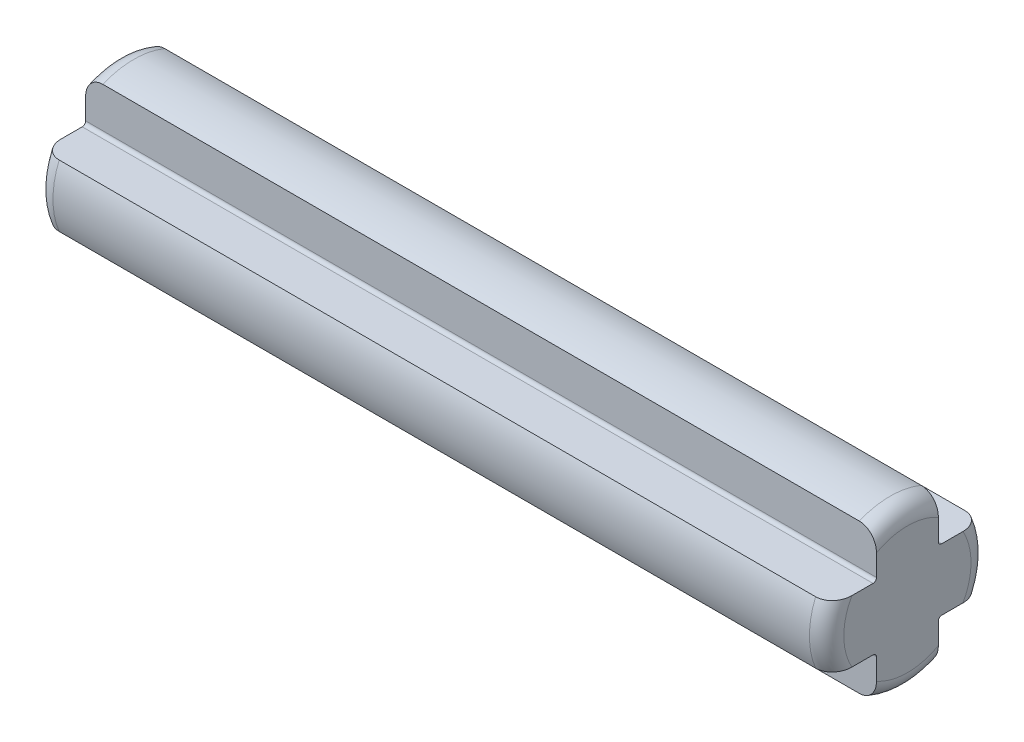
from build123d import *

# Parameters (mm, degrees)
EXTRUIR1_DEPTH = 11.5
REDONDEO1_R    = 0.5


with BuildPart() as part:
    # Croquis1 → Extruir1 (new, symmetric)
    with BuildSketch(Plane(origin=(0, 0, 0), x_dir=(0, 0, -1), z_dir=(1, 0, 0))):
        with BuildLine():
            Line((-0.9, 2.170829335), (-0.9, 1))
            ThreePointArc((-0.9, 1), (-0.929289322, 0.929289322), (-1, 0.9))
            Line((-1, 0.9), (-2.170829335, 0.9))
            ThreePointArc((-2.170829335, 0.9), (-2.35, 0), (-2.170829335, -0.9))
            Line((-2.170829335, -0.9), (-1, -0.9))
            ThreePointArc((-1, -0.9), (-0.929289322, -0.929289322), (-0.9, -1))
            Line((-0.9, -1), (-0.9, -2.170829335))
            ThreePointArc((-0.9, -2.170829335), (0, -2.35), (0.9, -2.170829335))
            Line((0.9, -2.170829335), (0.9, -1))
            ThreePointArc((0.9, -1), (0.929289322, -0.929289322), (1, -0.9))
            Line((1, -0.9), (2.170829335, -0.9))
            ThreePointArc((2.170829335, -0.9), (2.35, 0), (2.170829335, 0.9))
            Line((2.170829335, 0.9), (1, 0.9))
            ThreePointArc((1, 0.9), (0.929289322, 0.929289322), (0.9, 1))
            Line((0.9, 1), (0.9, 2.170829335))
            ThreePointArc((0.9, 2.170829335), (0, 2.35), (-0.9, 2.170829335))
        make_face()
    extrude(amount=EXTRUIR1_DEPTH, both=True)

    # Redondeo1
    redondeo1_edges = [part.edges().sort_by_distance(p)[0] for p in [
        (-11.5, 2.35, 0),
        (11.5, -2.35, 0),
        (-11.5, 0, -2.35),
        (-11.5, -2.35, 0),
        (-11.5, 0, 2.35),
        (11.5, 0, -2.35),
        (11.5, 0, 2.35),
        (11.5, 2.35, 0),
    ]]
    fillet(redondeo1_edges, radius=REDONDEO1_R)


solid = part.part
